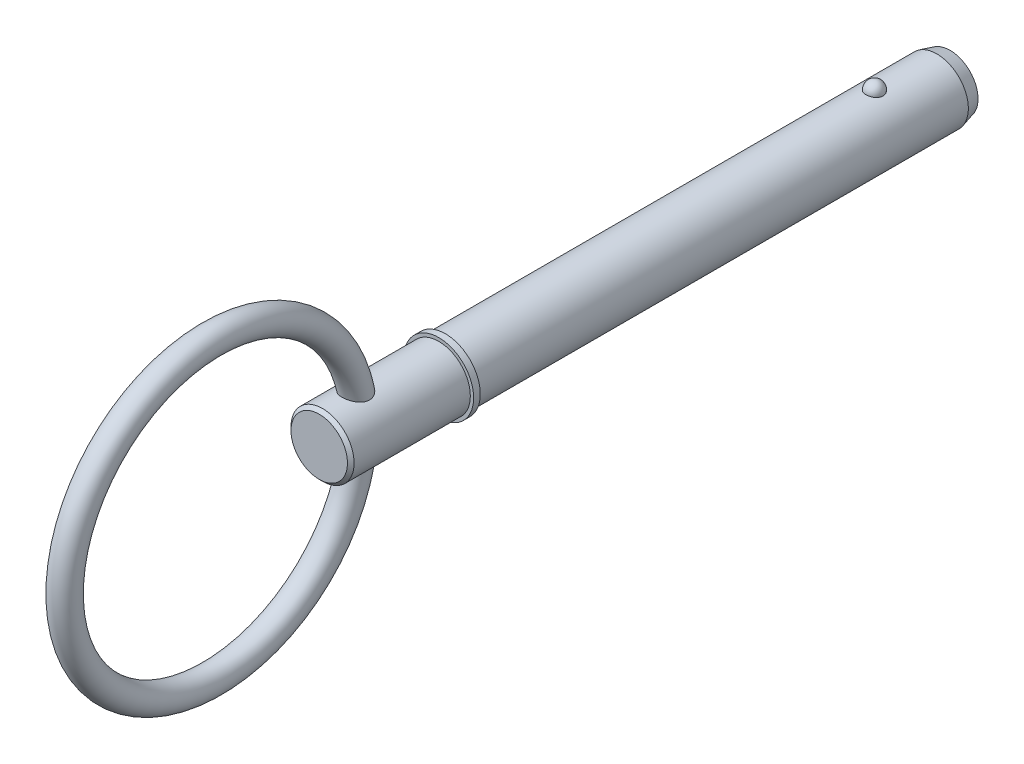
from build123d import *

# Parameters (mm, degrees)
SKETCH2_R           = 4.765
BOSS_EXTRUDE1_DEPTH = 63.5
BOSS_EXTRUDE2_START = 12.7
SKETCH3_R           = 4.765
BOSS_EXTRUDE2_DEPTH = 12.7
CHAMFER1_SIZE       = 2
CHAMFER1_SIZE2      = 0.535898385
SKETCH20_W          = 1
SKETCH20_H          = 5.265
SKETCH21_R          = 4.765
BOSS_EXTRUDE3_DEPTH = 19.05
CHAMFER2_SIZE       = 0.5
SKETCH24_R          = 2


with BuildPart() as part:
    # Sketch2 → Boss-Extrude1 (new body)
    with BuildSketch(Plane.XY):
        Circle(SKETCH2_R)
    extrude(amount=BOSS_EXTRUDE1_DEPTH)

    # Sketch3 → Boss-Extrude2 (add)
    with BuildSketch(Plane(origin=(0, 0, 0), x_dir=(-1, 0, 0), z_dir=(0, 0, -1)).offset(BOSS_EXTRUDE2_START)):
        Circle(SKETCH3_R)
    extrude(amount=-BOSS_EXTRUDE2_DEPTH)

    # Chamfer1
    chamfer1_edges = [part.edges().sort_by_distance(p)[0] for p in [
        (4.765, 0, -12.7),
    ]]
    chamfer1_side = [part.faces().sort_by_distance(p)[0] for p in [
        (4.765, 0, -6.35),
    ]]
    chamfer(chamfer1_edges, length=CHAMFER1_SIZE, length2=CHAMFER1_SIZE2, reference=chamfer1_side[0])

    # Sketch18 → Revolve1 (revolve)
    with BuildSketch(Plane(origin=(0, 0, 0), x_dir=(0, 0, -1), z_dir=(1, 0, 0))):
        with BuildLine():
            Line((1.29, 6.055), (1.29, 3.475))
            ThreePointArc((1.29, 3.475), (0, 4.765), (1.29, 6.055))
        make_face()
    revolve(axis=Axis((0, 6.055, -1.29), (0, -1, 0)))

    # Sketch20 → Revolve2 (revolve)
    with BuildSketch(Plane(origin=(0, 0, 0), x_dir=(0, 0, -1), z_dir=(1, 0, 0)), mode=Mode.PRIVATE) as revolve2_sk:
        with Locations((-64, 2.6325)):
            Rectangle(SKETCH20_W, SKETCH20_H)
    revolve(revolve2_sk.sketch.rotate(Axis((0, 0, 33.728787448), (0, 0, 1)), 90), axis=Axis((0, 0, 33.728787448), (0, 0, 1)))

    # Sketch21 → Boss-Extrude3 (add)
    with BuildSketch(Plane(origin=(0, 0, 63.5), x_dir=(-1, 0, 0), z_dir=(0, 0, -1))):
        Circle(SKETCH21_R)
    extrude(amount=-BOSS_EXTRUDE3_DEPTH)

    # Chamfer2
    chamfer2_edges = [part.edges().sort_by_distance(p)[0] for p in [
        (4.765, 0, 82.55),
    ]]
    chamfer(chamfer2_edges, length=CHAMFER2_SIZE)

    # Sweep1: sweep along a path in Sketch23
    with BuildLine(Plane(origin=(0, 0, 0), x_dir=(0, 0, -1), z_dir=(1, 0, 0))) as sweep1_path:
        CenterArc((-98.775, 0), 22.225, 0, 360)
    # Sketch24 → Sweep1 (sweep)
    with BuildSketch(Plane(origin=(0, 0, 0), x_dir=(1, 0, 0), z_dir=(0, 1, 0))):
        with Locations((0, -76.55)):
            Circle(SKETCH24_R)
    sweep(path=sweep1_path.line)


solid = part.part
